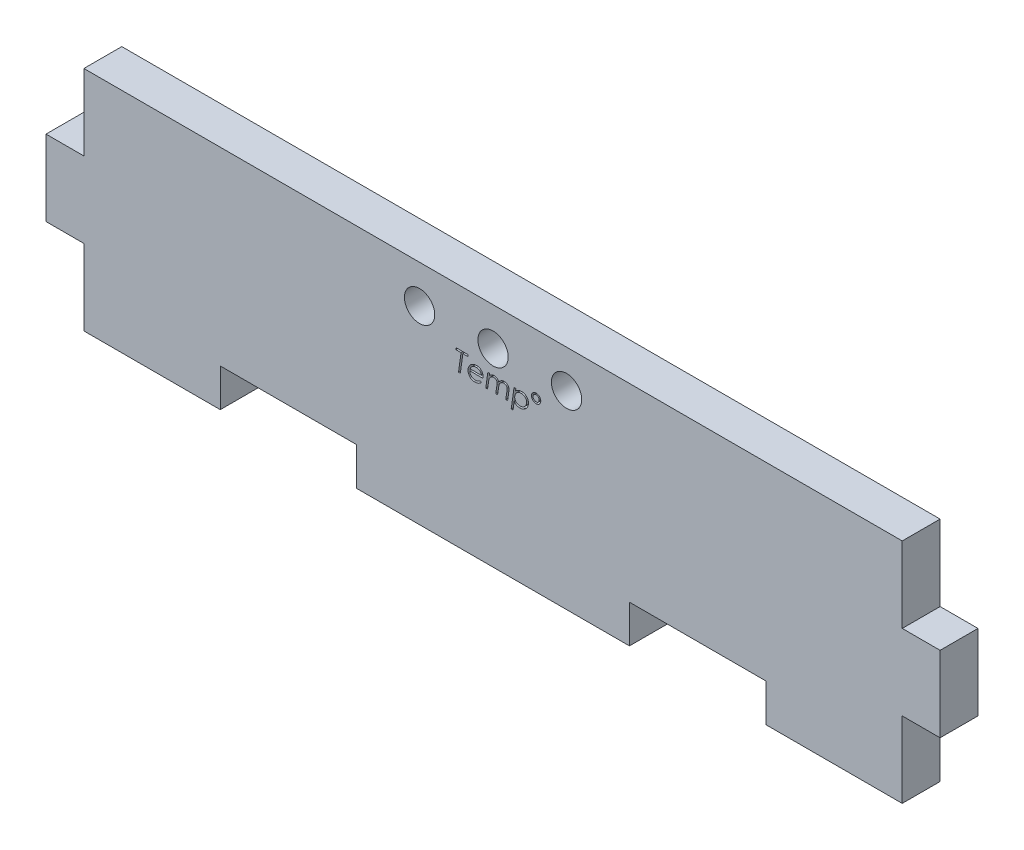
from build123d import *

# Parameters (mm, degrees)
ESQUISSE1_W                  = 118
ESQUISSE1_H                  = 30
BOSS_EXTRU_1_DEPTH           = 5
ENL_V_MAT_EXTRU_1_DEPTH      = 62.081912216
ENL_V_MAT_EXTRU_1_DEPTH_BACK = 62.081912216
ESQUISSE2_R                  = 2
ESQUISSE3_W                  = 5
ESQUISSE3_H                  = 10
ESQUISSE3_W_2                = 18
ESQUISSE3_H_2                = 5
ENL_V_MAT_EXTRU_2_DEPTH      = 62.081912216
ENL_V_MAT_EXTRU_3_DEPTH      = 62.081912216
ENL_V_MAT_EXTRU_3_DEPTH_BACK = 62.081912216
ESQUISSE4_R                  = 2
ENL_V_MAT_EXTRU_4_DEPTH      = 1


with BuildPart() as part:
    # Esquisse1 → Boss.-Extru.1 (new body)
    with BuildSketch(Plane.XY):
        Rectangle(ESQUISSE1_W, ESQUISSE1_H)
    extrude(amount=BOSS_EXTRU_1_DEPTH)

    # Esquisse2 → Enl_v. mat.-Extru.1 (cut, two sides: drawn at the far end of the back side and taken through both)
    with BuildSketch(Plane.XY.offset(5).offset(-ENL_V_MAT_EXTRU_1_DEPTH_BACK)):
        with Locations((-9.7, 10)):
            Circle(ESQUISSE2_R)
        with Locations((9.7, 10)):
            Circle(ESQUISSE2_R)
    extrude(amount=ENL_V_MAT_EXTRU_1_DEPTH + ENL_V_MAT_EXTRU_1_DEPTH_BACK, mode=Mode.SUBTRACT)

    # Esquisse3 → Enl_v. mat.-Extru.2 (cut, symmetric)
    with BuildSketch(Plane.XY.offset(5)):
        with Locations((-56.5, 10)):
            Rectangle(ESQUISSE3_W, ESQUISSE3_H)
        with Locations((-56.5, -10)):
            Rectangle(ESQUISSE3_W, ESQUISSE3_H)
        with Locations((-27, -12.5)):
            Rectangle(ESQUISSE3_W_2, ESQUISSE3_H_2)
    enl_v_mat_extru_2 = extrude(amount=ENL_V_MAT_EXTRU_2_DEPTH, both=True, mode=Mode.SUBTRACT)

    # Sym_trie1: Enl_v. mat.-Extru.2 across plane
    add(enl_v_mat_extru_2.mirror(Plane.ZY), mode=Mode.SUBTRACT)

    # Esquisse4 → Enl_v. mat.-Extru.3 (cut, two sides: drawn at the far end of the back side and taken through both)
    with BuildSketch(Plane.XY.offset(5).offset(-ENL_V_MAT_EXTRU_3_DEPTH_BACK)):
        with Locations((0, 10)):
            Circle(ESQUISSE4_R)
    extrude(amount=ENL_V_MAT_EXTRU_3_DEPTH + ENL_V_MAT_EXTRU_3_DEPTH_BACK, mode=Mode.SUBTRACT)

    # Esquisse5 → Enl_v. mat.-Extru.4 (cut)
    # profile 1 of 5: a face of its own
    with BuildSketch(Plane.XY.offset(5)):
        Polygon((-4.864316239, 7.645833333), (-3.303952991, 7.645833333), (-3.337873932, 7.408386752), (-3.984491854, 7.408386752), (-4.319991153, 5), (-4.559027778, 5), (-4.223528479, 7.408386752), (-4.898237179, 7.408386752), align=None)
    # profile 2 of 5: a face of its own
    with BuildSketch(Plane.XY.offset(5)):
        with BuildLine():
            Line((-1.315337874, 5.915865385), (-3.06650641, 5.915865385))
            add(Edge.make_bspline(
                [(-3.06650641, 5.915865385), (-3.066399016, 5.888820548), (-3.066190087, 5.836206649), (-3.058870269, 5.759529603), (-3.044866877, 5.68740124), (-3.025634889, 5.619387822), (-2.999500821, 5.555983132), (-2.967374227, 5.497282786), (-2.929841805, 5.442429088), (-2.899799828, 5.410058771), (-2.884711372, 5.393800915)],
                knots=[0, 0, 0, 0, 1.141903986, 2.221496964, 3.247378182, 4.241616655, 5.20192583, 6.136910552, 7.06427116, 8, 8, 8, 8], degree=3))
            add(Edge.make_bspline(
                [(-2.884711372, 5.393800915), (-2.868798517, 5.378556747), (-2.837071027, 5.348162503), (-2.783581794, 5.309937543), (-2.727055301, 5.276146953), (-2.665753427, 5.250340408), (-2.601271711, 5.228519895), (-2.532622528, 5.213945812), (-2.460204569, 5.205528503), (-2.410724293, 5.204203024), (-2.385437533, 5.203525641)],
                knots=[0, 0, 0, 0, 0.961911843, 1.917886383, 2.866064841, 3.834308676, 4.818310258, 5.837548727, 6.894885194, 8, 8, 8, 8], degree=3))
            add(Edge.make_bspline(
                [(-2.385437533, 5.203525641), (-2.351460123, 5.204200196), (-2.284450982, 5.20553053), (-2.186292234, 5.220252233), (-2.091594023, 5.241365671), (-2.0019052, 5.272887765), (-1.917487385, 5.311716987), (-1.840409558, 5.358777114), (-1.769833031, 5.41195729), (-1.729639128, 5.454002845), (-1.709668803, 5.474893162)],
                knots=[0, 0, 0, 0, 1.086940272, 2.143628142, 3.171290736, 4.18911527, 5.18108809, 6.140467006, 7.076091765, 8, 8, 8, 8], degree=3))
            Line((-1.709668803, 5.474893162), (-1.540064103, 5.339209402))
            add(Edge.make_bspline(
                [(-1.540064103, 5.339209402), (-1.564467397, 5.311665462), (-1.613775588, 5.256011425), (-1.701497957, 5.184228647), (-1.799037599, 5.120286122), (-1.90621171, 5.065651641), (-2.020783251, 5.021010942), (-2.14132744, 4.989321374), (-2.266418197, 4.969623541), (-2.351443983, 4.967269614), (-2.394447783, 4.96607906)],
                knots=[0, 0, 0, 0, 0.916959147, 1.852766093, 2.817448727, 3.822926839, 4.84868683, 5.879464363, 6.927489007, 8, 8, 8, 8], degree=3))
            add(Edge.make_bspline(
                [(-2.394447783, 4.96607906), (-2.431064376, 4.966789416), (-2.502255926, 4.96817052), (-2.605496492, 4.981833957), (-2.701846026, 5.00313446), (-2.791161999, 5.033695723), (-2.873869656, 5.071897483), (-2.948685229, 5.120590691), (-3.017328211, 5.17668072), (-3.076992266, 5.242364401), (-3.130103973, 5.31238793), (-3.176372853, 5.38535267), (-3.21600758, 5.460154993), (-3.247569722, 5.53757013), (-3.273662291, 5.616526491), (-3.290764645, 5.698330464), (-3.301746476, 5.782001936), (-3.303214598, 5.838625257), (-3.303952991, 5.867104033)],
                knots=[0, 0, 0, 0, 1.220623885, 2.373189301, 3.466721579, 4.506480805, 5.516015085, 6.496695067, 7.47595788, 8.46413249, 9.448170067, 10.404436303, 11.342724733, 12.267370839, 13.189761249, 14.112019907, 15.050437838, 16, 16, 16, 16], degree=3))
            add(Edge.make_bspline(
                [(-3.303952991, 5.867104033), (-3.303349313, 5.89061491), (-3.302144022, 5.937556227), (-3.295316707, 6.00774918), (-3.283014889, 6.077145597), (-3.265907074, 6.145814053), (-3.24429758, 6.21394706), (-3.216825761, 6.281093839), (-3.185913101, 6.348195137), (-3.149158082, 6.413351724), (-3.109175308, 6.476932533), (-3.065376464, 6.537238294), (-3.017786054, 6.593621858), (-2.967537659, 6.646745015), (-2.913865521, 6.696136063), (-2.857010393, 6.741788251), (-2.796926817, 6.783953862), (-2.733414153, 6.821666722), (-2.667988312, 6.85628571), (-2.600640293, 6.885927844), (-2.532034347, 6.910762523), (-2.462414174, 6.931763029), (-2.391142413, 6.947467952), (-2.318616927, 6.959210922), (-2.244597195, 6.966330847), (-2.194824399, 6.967051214), (-2.169721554, 6.96741453)],
                knots=[0, 0, 0, 0, 0.96612707, 1.928948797, 2.894421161, 3.859211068, 4.83486301, 5.828310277, 6.83824884, 7.868334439, 8.899417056, 9.923036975, 10.927744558, 11.928984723, 12.925609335, 13.922101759, 14.92294714, 15.93879023, 16.955074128, 17.962609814, 18.959234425, 19.951407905, 20.948191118, 21.955412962, 22.968815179, 24, 24, 24, 24], degree=3))
            add(Edge.make_bspline(
                [(-2.169721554, 6.96741453), (-2.13912035, 6.966761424), (-2.078923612, 6.965476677), (-1.990680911, 6.953577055), (-1.906592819, 6.933929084), (-1.826392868, 6.906872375), (-1.750460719, 6.871687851), (-1.67834602, 6.829155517), (-1.61067274, 6.77826828), (-1.547609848, 6.720287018), (-1.489934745, 6.656653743), (-1.439906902, 6.587755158), (-1.397115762, 6.514936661), (-1.362703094, 6.437493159), (-1.335375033, 6.356090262), (-1.316649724, 6.270240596), (-1.304480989, 6.180339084), (-1.303246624, 6.118901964), (-1.302617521, 6.087590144)],
                knots=[0, 0, 0, 0, 1.061019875, 2.087170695, 3.081596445, 4.052481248, 5.017624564, 5.979259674, 6.951168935, 7.948742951, 8.946730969, 9.924860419, 10.897059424, 11.870821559, 12.859129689, 13.870109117, 14.914487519, 16, 16, 16, 16], degree=3))
            add(Edge.make_bspline(
                [(-1.302617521, 6.087590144), (-1.302641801, 6.075217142), (-1.302692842, 6.049206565), (-1.305964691, 6.008247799), (-1.309188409, 5.963287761), (-1.313232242, 5.93210323), (-1.315337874, 5.915865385)],
                knots=[0, 0, 0, 0, 0.86132866, 1.810688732, 2.860021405, 4, 4, 4, 4], degree=3))
        make_face()
        with BuildLine():
            add(Edge.make_bspline(
                [(-1.540064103, 6.153311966), (-1.541415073, 6.174381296), (-1.544053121, 6.215523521), (-1.554970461, 6.275504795), (-1.570864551, 6.332488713), (-1.591883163, 6.386631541), (-1.618826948, 6.437480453), (-1.650653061, 6.485357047), (-1.687984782, 6.530130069), (-1.730433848, 6.571069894), (-1.776173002, 6.608827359), (-1.825655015, 6.641211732), (-1.878208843, 6.668297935), (-1.933206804, 6.691262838), (-1.991287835, 6.708778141), (-2.052187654, 6.720813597), (-2.115998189, 6.728421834), (-2.159629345, 6.729445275), (-2.181911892, 6.729967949)],
                knots=[0, 0, 0, 0, 1.053254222, 2.056696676, 3.036805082, 4.003125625, 4.94997018, 5.903976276, 6.868362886, 7.853814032, 8.844225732, 9.825167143, 10.799544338, 11.792113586, 12.796563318, 13.82227867, 14.887831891, 16, 16, 16, 16], degree=3))
            add(Edge.make_bspline(
                [(-2.181911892, 6.729967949), (-2.206127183, 6.729360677), (-2.254122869, 6.728157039), (-2.325066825, 6.721550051), (-2.393656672, 6.708931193), (-2.460290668, 6.692884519), (-2.524502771, 6.670851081), (-2.586626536, 6.644503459), (-2.646357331, 6.612812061), (-2.703839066, 6.577012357), (-2.758395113, 6.537140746), (-2.808207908, 6.492426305), (-2.855265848, 6.445717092), (-2.897251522, 6.394122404), (-2.935506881, 6.339361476), (-2.968530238, 6.280351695), (-2.999682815, 6.218982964), (-3.015536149, 6.175408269), (-3.02357522, 6.153311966)],
                knots=[0, 0, 0, 0, 1.064809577, 2.1104957, 3.128260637, 4.128567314, 5.120881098, 6.109143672, 7.092387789, 8.090248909, 9.084475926, 10.058473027, 11.03061017, 11.996271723, 12.978748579, 13.963341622, 14.967230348, 16, 16, 16, 16], degree=3))
            Line((-3.02357522, 6.153311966), (-1.540064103, 6.153311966))
        make_face(mode=Mode.SUBTRACT)
    # profile 3 of 5: a face of its own
    with BuildSketch(Plane.XY.offset(5)):
        with BuildLine():
            Line((-0.68886051, 6.93349359), (-0.449823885, 6.93349359))
            Line((-0.449823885, 6.93349359), (-0.493285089, 6.628735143))
            add(Edge.make_bspline(
                [(-0.493285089, 6.628735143), (-0.473593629, 6.654196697), (-0.434384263, 6.704895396), (-0.364475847, 6.771048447), (-0.287639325, 6.829713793), (-0.203295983, 6.877945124), (-0.115644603, 6.917954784), (-0.026061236, 6.945966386), (0.063751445, 6.963926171), (0.1239237, 6.966255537), (0.153862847, 6.96741453)],
                knots=[0, 0, 0, 0, 1.019636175, 2.030285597, 3.042363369, 4.07945189, 5.105351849, 6.092548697, 7.050933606, 8, 8, 8, 8], degree=3))
            add(Edge.make_bspline(
                [(0.153862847, 6.96741453), (0.172249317, 6.966963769), (0.208408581, 6.966077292), (0.262019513, 6.960337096), (0.313720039, 6.949617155), (0.363946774, 6.93504745), (0.412915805, 6.917525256), (0.459582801, 6.893978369), (0.505462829, 6.868048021), (0.533904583, 6.847050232), (0.548193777, 6.836500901)],
                knots=[0, 0, 0, 0, 1.042797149, 2.050789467, 3.052938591, 4.032852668, 5.015580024, 5.996927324, 6.993652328, 8, 8, 8, 8], degree=3))
            add(Edge.make_bspline(
                [(0.548193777, 6.836500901), (0.569584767, 6.818121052), (0.613198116, 6.780647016), (0.666777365, 6.709146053), (0.712200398, 6.625887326), (0.734026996, 6.564265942), (0.745359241, 6.532272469)],
                knots=[0, 0, 0, 0, 0.917554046, 1.870769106, 2.894515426, 4, 4, 4, 4], degree=3))
            add(Edge.make_bspline(
                [(0.745359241, 6.532272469), (0.768052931, 6.565579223), (0.812742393, 6.631168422), (0.892568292, 6.717358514), (0.979030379, 6.792924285), (1.073220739, 6.854764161), (1.17111456, 6.90474082), (1.271210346, 6.940464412), (1.372011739, 6.96364514), (1.439910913, 6.966164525), (1.473599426, 6.96741453)],
                knots=[0, 0, 0, 0, 1.093285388, 2.152948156, 3.180331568, 4.205067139, 5.205058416, 6.158203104, 7.086183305, 8, 8, 8, 8], degree=3))
            add(Edge.make_bspline(
                [(1.473599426, 6.96741453), (1.495888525, 6.966945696), (1.539553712, 6.966027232), (1.603328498, 6.957652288), (1.66435968, 6.945340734), (1.722062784, 6.926475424), (1.777075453, 6.903270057), (1.828778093, 6.874465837), (1.87729848, 6.84018407), (1.922636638, 6.801216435), (1.963737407, 6.758126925), (1.999590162, 6.711566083), (2.030096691, 6.662136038), (2.054470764, 6.609186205), (2.073656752, 6.553241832), (2.087288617, 6.494100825), (2.096112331, 6.432012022), (2.096983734, 6.389552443), (2.097426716, 6.367967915)],
                knots=[0, 0, 0, 0, 1.101204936, 2.15730208, 3.174669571, 4.17441865, 5.152536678, 6.122040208, 7.093586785, 8.084370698, 9.072688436, 10.031633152, 10.984194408, 11.937515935, 12.90686213, 13.902445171, 14.933698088, 16, 16, 16, 16], degree=3))
            add(Edge.make_bspline(
                [(2.097426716, 6.367967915), (2.097080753, 6.346760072), (2.096344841, 6.301647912), (2.091226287, 6.230409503), (2.083248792, 6.151582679), (2.075862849, 6.096757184), (2.071986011, 6.067979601)],
                knots=[0, 0, 0, 0, 0.84467635, 1.796749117, 2.843526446, 4, 4, 4, 4], degree=3))
            Line((2.071986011, 6.067979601), (1.921461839, 5))
            Line((1.921461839, 5), (1.682425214, 5))
            Line((1.682425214, 5), (1.813868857, 5.933885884))
            add(Edge.make_bspline(
                [(1.813868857, 5.933885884), (1.817084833, 5.957378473), (1.823296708, 6.002755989), (1.83168109, 6.068314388), (1.839319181, 6.128868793), (1.845167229, 6.184353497), (1.849346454, 6.234734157), (1.852499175, 6.279787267), (1.854971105, 6.319709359), (1.855133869, 6.34464411), (1.855210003, 6.356307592)],
                knots=[0, 0, 0, 0, 1.339891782, 2.588091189, 3.734744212, 4.788733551, 5.740509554, 6.591206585, 7.341022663, 8, 8, 8, 8], degree=3))
            add(Edge.make_bspline(
                [(1.855210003, 6.356307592), (1.854962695, 6.369577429), (1.854479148, 6.39552323), (1.848973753, 6.433530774), (1.840045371, 6.469811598), (1.827089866, 6.504313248), (1.811385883, 6.537409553), (1.791421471, 6.568395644), (1.768112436, 6.597477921), (1.741473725, 6.62465137), (1.712047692, 6.649103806), (1.680582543, 6.671579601), (1.646011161, 6.689066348), (1.609611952, 6.704316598), (1.570998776, 6.715674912), (1.53012572, 6.72449901), (1.486953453, 6.729022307), (1.457354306, 6.72964954), (1.442328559, 6.729967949)],
                knots=[0, 0, 0, 0, 1.018645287, 1.991702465, 2.942937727, 3.883267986, 4.81799953, 5.751646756, 6.707517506, 7.676781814, 8.668957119, 9.643999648, 10.639510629, 11.63751605, 12.672216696, 13.726227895, 14.845739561, 16, 16, 16, 16], degree=3))
            add(Edge.make_bspline(
                [(1.442328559, 6.729967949), (1.410069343, 6.728453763), (1.345913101, 6.725442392), (1.2513689, 6.703811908), (1.161040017, 6.666283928), (1.075696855, 6.616364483), (0.998350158, 6.556700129), (0.931384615, 6.490922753), (0.876735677, 6.419436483), (0.834287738, 6.341151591), (0.800750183, 6.254470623), (0.772685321, 6.157863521), (0.748176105, 6.049898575), (0.736234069, 5.97372297), (0.729988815, 5.933885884)],
                knots=[0, 0, 0, 0, 0.984220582, 1.957390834, 2.941640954, 3.958892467, 4.966178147, 5.915531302, 6.815990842, 7.701589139, 8.623741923, 9.647346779, 10.769647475, 12, 12, 12, 12], degree=3))
            Line((0.729988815, 5.933885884), (0.598545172, 5))
            Line((0.598545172, 5), (0.359508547, 5))
            Line((0.359508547, 5), (0.510032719, 6.067979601))
            add(Edge.make_bspline(
                [(0.510032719, 6.067979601), (0.513719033, 6.09499144), (0.520671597, 6.145937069), (0.528209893, 6.218396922), (0.532646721, 6.282403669), (0.533491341, 6.322381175), (0.53388338, 6.340937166)],
                knots=[0, 0, 0, 0, 1.19306778, 2.250183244, 3.187803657, 4, 4, 4, 4], degree=3))
            add(Edge.make_bspline(
                [(0.53388338, 6.340937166), (0.533617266, 6.355262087), (0.533092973, 6.383484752), (0.52780716, 6.424705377), (0.518599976, 6.463658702), (0.50669304, 6.500436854), (0.490391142, 6.534799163), (0.470930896, 6.567003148), (0.44786508, 6.597088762), (0.421369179, 6.624427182), (0.392290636, 6.649306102), (0.361002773, 6.671221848), (0.327149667, 6.689389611), (0.291192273, 6.704039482), (0.253096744, 6.715891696), (0.213008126, 6.724307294), (0.170587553, 6.729100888), (0.141684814, 6.729673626), (0.126832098, 6.729967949)],
                knots=[0, 0, 0, 0, 1.083420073, 2.134531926, 3.136387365, 4.108556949, 5.053325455, 6.006940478, 6.950668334, 7.914903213, 8.881913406, 9.84224937, 10.799137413, 11.782089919, 12.77561843, 13.813731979, 14.876507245, 16, 16, 16, 16], degree=3))
            add(Edge.make_bspline(
                [(0.126832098, 6.729967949), (0.1016923, 6.729150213), (0.051445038, 6.727515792), (-0.022918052, 6.714368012), (-0.095782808, 6.692969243), (-0.165895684, 6.663309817), (-0.232622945, 6.627774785), (-0.293095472, 6.585571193), (-0.347957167, 6.538798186), (-0.395923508, 6.485707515), (-0.438072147, 6.427041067), (-0.474366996, 6.361852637), (-0.505584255, 6.290547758), (-0.530022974, 6.213811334), (-0.550540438, 6.135918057), (-0.568753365, 6.059990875), (-0.583082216, 5.98690764), (-0.590760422, 5.93920806), (-0.594517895, 5.915865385)],
                knots=[0, 0, 0, 0, 1.001330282, 2.00137268, 2.99943047, 4.021922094, 5.029962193, 6.006456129, 6.954907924, 7.896883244, 8.850364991, 9.827569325, 10.86483684, 11.946870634, 13.033042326, 14.074744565, 15.057840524, 16, 16, 16, 16], degree=3))
            Line((-0.594517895, 5.915865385), (-0.724371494, 5))
            Line((-0.724371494, 5), (-0.96340812, 5))
            Line((-0.96340812, 5), (-0.68886051, 6.93349359))
        make_face()
    # profile 4 of 5: a face of its own
    with BuildSketch(Plane.XY.offset(5)):
        with BuildLine():
            Line((2.771075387, 6.93349359), (3.010112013, 6.93349359))
            Line((3.010112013, 6.93349359), (2.966120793, 6.623965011))
            add(Edge.make_bspline(
                [(2.966120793, 6.623965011), (2.994620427, 6.651352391), (3.05055205, 6.705101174), (3.141086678, 6.775251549), (3.234732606, 6.834327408), (3.331314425, 6.883210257), (3.431243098, 6.920811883), (3.534000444, 6.948065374), (3.639947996, 6.964445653), (3.711617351, 6.966416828), (3.747892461, 6.96741453)],
                knots=[0, 0, 0, 0, 1.080491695, 2.120506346, 3.125967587, 4.104895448, 5.075956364, 6.040563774, 7.008240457, 8, 8, 8, 8], degree=3))
            add(Edge.make_bspline(
                [(3.747892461, 6.96741453), (3.780789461, 6.966768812), (3.84538564, 6.965500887), (3.939943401, 6.95356108), (4.0299853, 6.934170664), (4.115244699, 6.906273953), (4.196243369, 6.871433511), (4.27246549, 6.828227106), (4.343922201, 6.776894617), (4.410184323, 6.718354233), (4.470676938, 6.653986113), (4.523228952, 6.584214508), (4.568373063, 6.510234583), (4.604133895, 6.431145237), (4.633168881, 6.348266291), (4.653240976, 6.260644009), (4.664882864, 6.168468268), (4.666593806, 6.105467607), (4.667467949, 6.073279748)],
                knots=[0, 0, 0, 0, 1.096505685, 2.153086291, 3.17225003, 4.163343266, 5.139547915, 6.107720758, 7.078792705, 8.068010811, 9.051652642, 10.018964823, 10.975725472, 11.935220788, 12.907721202, 13.899444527, 14.92679881, 16, 16, 16, 16], degree=3))
            add(Edge.make_bspline(
                [(4.667467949, 6.073279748), (4.666494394, 6.035941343), (4.664575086, 5.962330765), (4.648015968, 5.854229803), (4.622168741, 5.750092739), (4.585440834, 5.649749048), (4.537364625, 5.5536886), (4.47926889, 5.461584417), (4.41085988, 5.373444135), (4.332612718, 5.290929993), (4.247547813, 5.215130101), (4.157666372, 5.148502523), (4.064249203, 5.091987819), (3.966686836, 5.045998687), (3.865561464, 5.009853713), (3.76041531, 4.984323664), (3.651688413, 4.969311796), (3.577980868, 4.967165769), (3.540656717, 4.96607906)],
                knots=[0, 0, 0, 0, 1.022089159, 2.01499164, 2.987849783, 3.956837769, 4.934916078, 5.924287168, 6.934719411, 7.985541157, 9.034300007, 10.051394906, 11.045510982, 12.01949953, 13.000493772, 13.981583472, 14.977910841, 16, 16, 16, 16], degree=3))
            add(Edge.make_bspline(
                [(3.540656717, 4.96607906), (3.50065534, 4.967276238), (3.42267611, 4.969610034), (3.309629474, 4.988449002), (3.204075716, 5.01935205), (3.105547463, 5.062122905), (3.01473501, 5.119459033), (2.931055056, 5.189975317), (2.854550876, 5.274470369), (2.811288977, 5.338627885), (2.789095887, 5.371540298)],
                knots=[0, 0, 0, 0, 1.071471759, 2.088741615, 3.060992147, 4.012786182, 4.957251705, 5.92834886, 6.937255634, 8, 8, 8, 8], degree=3))
            Line((2.789095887, 5.371540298), (2.635391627, 4.287660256))
            Line((2.635391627, 4.287660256), (2.396355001, 4.287660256))
            Line((2.396355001, 4.287660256), (2.771075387, 6.93349359))
        make_face()
        with BuildLine():
            add(Edge.make_bspline(
                [(3.736232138, 6.729967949), (3.696753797, 6.728620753), (3.618862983, 6.725962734), (3.504530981, 6.705537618), (3.395697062, 6.670679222), (3.309706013, 6.630919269), (3.244621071, 6.592686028), (3.197955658, 6.561152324), (3.154494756, 6.52587774), (3.113385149, 6.488029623), (3.074652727, 6.447235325), (3.038643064, 6.403338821), (3.005672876, 6.356188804), (2.964989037, 6.290397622), (2.921934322, 6.203457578), (2.885196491, 6.093276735), (2.862815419, 5.978428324), (2.859966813, 5.900240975), (2.858527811, 5.860743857)],
                knots=[0, 0, 0, 0, 1.373302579, 2.709527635, 4.025818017, 5.340600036, 5.996436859, 6.651235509, 7.298369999, 7.942284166, 8.594596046, 9.254254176, 9.916057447, 10.595111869, 11.945097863, 13.280714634, 14.626325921, 16, 16, 16, 16], degree=3))
            add(Edge.make_bspline(
                [(2.858527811, 5.860743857), (2.859148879, 5.837039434), (2.860367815, 5.790516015), (2.869650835, 5.722390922), (2.884217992, 5.657481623), (2.90541158, 5.596053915), (2.933621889, 5.538577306), (2.966170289, 5.483550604), (3.005778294, 5.432396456), (3.051439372, 5.38551655), (3.101391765, 5.342807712), (3.155255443, 5.305288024), (3.212988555, 5.27404987), (3.273871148, 5.247809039), (3.338698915, 5.228355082), (3.406786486, 5.214176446), (3.478379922, 5.204692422), (3.527375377, 5.203919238), (3.552317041, 5.203525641)],
                knots=[0, 0, 0, 0, 1.059539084, 2.079501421, 3.068245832, 4.030023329, 4.976860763, 5.926494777, 6.883948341, 7.861554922, 8.847708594, 9.818397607, 10.790499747, 11.777918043, 12.777395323, 13.81072841, 14.885527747, 16, 16, 16, 16], degree=3))
            add(Edge.make_bspline(
                [(3.552317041, 5.203525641), (3.582036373, 5.20418138), (3.640651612, 5.205474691), (3.726767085, 5.217426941), (3.809665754, 5.237111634), (3.889183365, 5.264717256), (3.96557776, 5.299928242), (4.038504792, 5.342938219), (4.10755724, 5.394543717), (4.173391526, 5.45209602), (4.233362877, 5.515821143), (4.28633243, 5.583725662), (4.330383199, 5.655982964), (4.367329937, 5.731211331), (4.395348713, 5.810247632), (4.415830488, 5.892553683), (4.427356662, 5.978610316), (4.429124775, 6.037206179), (4.430021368, 6.066919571)],
                knots=[0, 0, 0, 0, 1.040175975, 2.051532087, 3.037326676, 4.019426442, 4.993721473, 5.978273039, 6.97798342, 8.008029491, 9.036439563, 10.03746972, 11.017814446, 11.994463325, 12.966949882, 13.948192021, 14.959548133, 16, 16, 16, 16], degree=3))
            add(Edge.make_bspline(
                [(4.430021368, 6.066919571), (4.42940347, 6.091153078), (4.42819482, 6.138555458), (4.418933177, 6.207923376), (4.404212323, 6.273785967), (4.383727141, 6.336150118), (4.356343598, 6.394605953), (4.322562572, 6.449111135), (4.284124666, 6.501104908), (4.238652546, 6.5479155), (4.18924247, 6.590847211), (4.135394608, 6.628186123), (4.077682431, 6.659437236), (4.016655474, 6.6857985), (3.951587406, 6.705039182), (3.883188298, 6.719388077), (3.811048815, 6.728809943), (3.761526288, 6.729576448), (3.736232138, 6.729967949)],
                knots=[0, 0, 0, 0, 1.076738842, 2.106174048, 3.10432078, 4.072684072, 5.017588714, 5.965620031, 6.918839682, 7.885163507, 8.859461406, 9.824348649, 10.790640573, 11.77215711, 12.773171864, 13.80032876, 14.876494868, 16, 16, 16, 16], degree=3))
        make_face(mode=Mode.SUBTRACT)
    # profile 5 of 5: a face of its own
    with BuildSketch(Plane.XY.offset(5)):
        with BuildLine():
            add(Edge.make_bspline(
                [(6.295673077, 7.137019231), (6.295217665, 7.115967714), (6.294322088, 7.07456949), (6.285627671, 7.013626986), (6.271061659, 6.955414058), (6.25238612, 6.899084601), (6.22643716, 6.84609097), (6.195719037, 6.795256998), (6.158636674, 6.747529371), (6.117293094, 6.70234119), (6.071876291, 6.661174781), (6.023634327, 6.624798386), (5.972418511, 6.594673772), (5.919324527, 6.56944856), (5.863631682, 6.550310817), (5.805751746, 6.536679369), (5.745441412, 6.527740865), (5.704385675, 6.526880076), (5.68350611, 6.526442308)],
                knots=[0, 0, 0, 0, 1.048753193, 2.062393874, 3.059725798, 4.03711221, 5.013824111, 5.993903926, 6.992478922, 8.020738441, 9.043061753, 10.043343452, 11.026424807, 11.999358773, 12.968420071, 13.955122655, 14.960044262, 16, 16, 16, 16], degree=3))
            add(Edge.make_bspline(
                [(5.68350611, 6.526442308), (5.662624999, 6.526875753), (5.621566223, 6.527728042), (5.561277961, 6.536728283), (5.503259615, 6.550145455), (5.447812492, 6.570146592), (5.394675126, 6.595022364), (5.343911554, 6.625370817), (5.295971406, 6.661852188), (5.25098657, 6.703270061), (5.209715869, 6.748608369), (5.173569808, 6.797085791), (5.142350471, 6.847899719), (5.11827437, 6.902164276), (5.098183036, 6.958360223), (5.084815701, 7.01745522), (5.07577798, 7.078968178), (5.074944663, 7.120907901), (5.074519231, 7.142319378)],
                knots=[0, 0, 0, 0, 1.037227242, 2.039512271, 3.023626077, 3.993053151, 4.963434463, 5.936395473, 6.927031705, 7.952593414, 8.972234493, 9.969891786, 10.954906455, 11.929570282, 12.915563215, 13.916770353, 14.936449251, 16, 16, 16, 16], degree=3))
            add(Edge.make_bspline(
                [(5.074519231, 7.142319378), (5.074962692, 7.162845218), (5.075834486, 7.203196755), (5.084719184, 7.26267751), (5.098819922, 7.319931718), (5.11912621, 7.374771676), (5.145030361, 7.42711454), (5.175488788, 7.477890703), (5.213191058, 7.525440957), (5.255209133, 7.570817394), (5.301290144, 7.612223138), (5.350203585, 7.648550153), (5.401453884, 7.678899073), (5.454693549, 7.703915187), (5.509998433, 7.723793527), (5.567796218, 7.737386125), (5.62757929, 7.746245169), (5.668280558, 7.74714325), (5.688806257, 7.747596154)],
                knots=[0, 0, 0, 0, 1.027628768, 2.020204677, 3.0054932, 3.977172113, 4.942988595, 5.928118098, 6.937247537, 7.976812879, 9.023474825, 10.036014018, 11.024160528, 12.002107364, 12.979092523, 13.962271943, 14.972371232, 16, 16, 16, 16], degree=3))
            add(Edge.make_bspline(
                [(5.688806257, 7.747596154), (5.709333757, 7.74715515), (5.749863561, 7.746284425), (5.809449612, 7.737311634), (5.866938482, 7.723887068), (5.92186871, 7.703905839), (5.97456797, 7.678877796), (6.025221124, 7.648676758), (6.073187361, 7.612208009), (6.118122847, 7.570587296), (6.159982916, 7.525623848), (6.195949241, 7.477026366), (6.227218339, 7.426566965), (6.251926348, 7.37321537), (6.271976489, 7.317802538), (6.28544392, 7.259607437), (6.294352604, 7.199130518), (6.295229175, 7.157899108), (6.295673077, 7.137019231)],
                knots=[0, 0, 0, 0, 1.02774298, 2.029191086, 3.012479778, 3.981238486, 4.951290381, 5.931946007, 6.930416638, 7.964088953, 8.997761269, 10.003308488, 10.98854748, 11.966603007, 12.943696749, 13.935593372, 14.954569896, 16, 16, 16, 16], degree=3))
        make_face()
        with BuildLine():
            add(Edge.make_bspline(
                [(6.092147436, 7.133839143), (6.091961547, 7.148175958), (6.091597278, 7.176270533), (6.085199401, 7.21734507), (6.076554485, 7.256676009), (6.063612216, 7.29412232), (6.047124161, 7.329829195), (6.02682697, 7.36389289), (6.002987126, 7.396311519), (5.97546771, 7.426348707), (5.945373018, 7.453456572), (5.914240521, 7.478437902), (5.880543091, 7.498510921), (5.845417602, 7.514748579), (5.809135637, 7.528656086), (5.770879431, 7.537011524), (5.731252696, 7.543545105), (5.704206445, 7.543892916), (5.690396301, 7.544070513)],
                knots=[0, 0, 0, 0, 1.073815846, 2.104260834, 3.110142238, 4.090487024, 5.068501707, 6.054558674, 7.058781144, 8.080932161, 9.103083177, 10.094199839, 11.068889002, 12.034896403, 12.994706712, 13.974782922, 14.965899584, 16, 16, 16, 16], degree=3))
            add(Edge.make_bspline(
                [(5.690396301, 7.544070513), (5.676605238, 7.543566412), (5.649278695, 7.542567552), (5.608862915, 7.537537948), (5.570155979, 7.527605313), (5.532629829, 7.515165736), (5.497018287, 7.497966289), (5.463076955, 7.476955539), (5.429764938, 7.45328376), (5.399266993, 7.425181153), (5.370290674, 7.395522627), (5.346327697, 7.362718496), (5.324409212, 7.329420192), (5.307795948, 7.293714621), (5.294326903, 7.25686958), (5.284573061, 7.218369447), (5.279543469, 7.178140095), (5.278547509, 7.150811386), (5.278044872, 7.137019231)],
                knots=[0, 0, 0, 0, 1.028328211, 2.037599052, 3.027533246, 4.00184637, 4.979445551, 5.966222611, 6.974892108, 8.019112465, 9.052904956, 10.058820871, 11.041372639, 12.01897182, 12.985245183, 13.962400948, 14.971671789, 16, 16, 16, 16], degree=3))
            add(Edge.make_bspline(
                [(5.278044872, 7.137019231), (5.278530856, 7.123400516), (5.279487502, 7.096592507), (5.284732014, 7.056935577), (5.294193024, 7.018651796), (5.308305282, 6.982121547), (5.325241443, 6.946572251), (5.346588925, 6.912765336), (5.371613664, 6.88029592), (5.400067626, 6.849848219), (5.431034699, 6.821904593), (5.46395653, 6.797556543), (5.498082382, 6.776575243), (5.533664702, 6.75966369), (5.570554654, 6.746256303), (5.608707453, 6.736613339), (5.648383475, 6.731421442), (5.67518887, 6.730457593), (5.688806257, 6.729967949)],
                knots=[0, 0, 0, 0, 1.019647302, 2.00714349, 2.988599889, 3.963710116, 4.933695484, 5.931760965, 6.950121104, 7.998103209, 9.046919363, 10.067852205, 11.058972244, 12.040874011, 13.011400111, 13.99285651, 14.980352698, 16, 16, 16, 16], degree=3))
            add(Edge.make_bspline(
                [(5.688806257, 6.729967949), (5.702438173, 6.730158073), (5.729304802, 6.730532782), (5.768599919, 6.736952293), (5.806641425, 6.745475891), (5.842757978, 6.759295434), (5.877936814, 6.775472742), (5.911450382, 6.795834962), (5.943423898, 6.81978377), (5.973292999, 6.847390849), (6.001300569, 6.876924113), (6.025152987, 6.909236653), (6.046186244, 6.942680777), (6.06298314, 6.977933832), (6.075810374, 7.014781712), (6.085590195, 7.052838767), (6.090676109, 7.092892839), (6.091651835, 7.120046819), (6.092147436, 7.133839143)],
                knots=[0, 0, 0, 0, 1.029809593, 2.029612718, 3.005277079, 3.973499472, 4.947973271, 5.931204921, 6.933505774, 7.96461525, 9.004778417, 10.007079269, 10.997279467, 11.989551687, 12.953244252, 13.9450664, 14.956237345, 16, 16, 16, 16], degree=3))
        make_face(mode=Mode.SUBTRACT)
    extrude(amount=-ENL_V_MAT_EXTRU_4_DEPTH, mode=Mode.SUBTRACT)


solid = part.part
